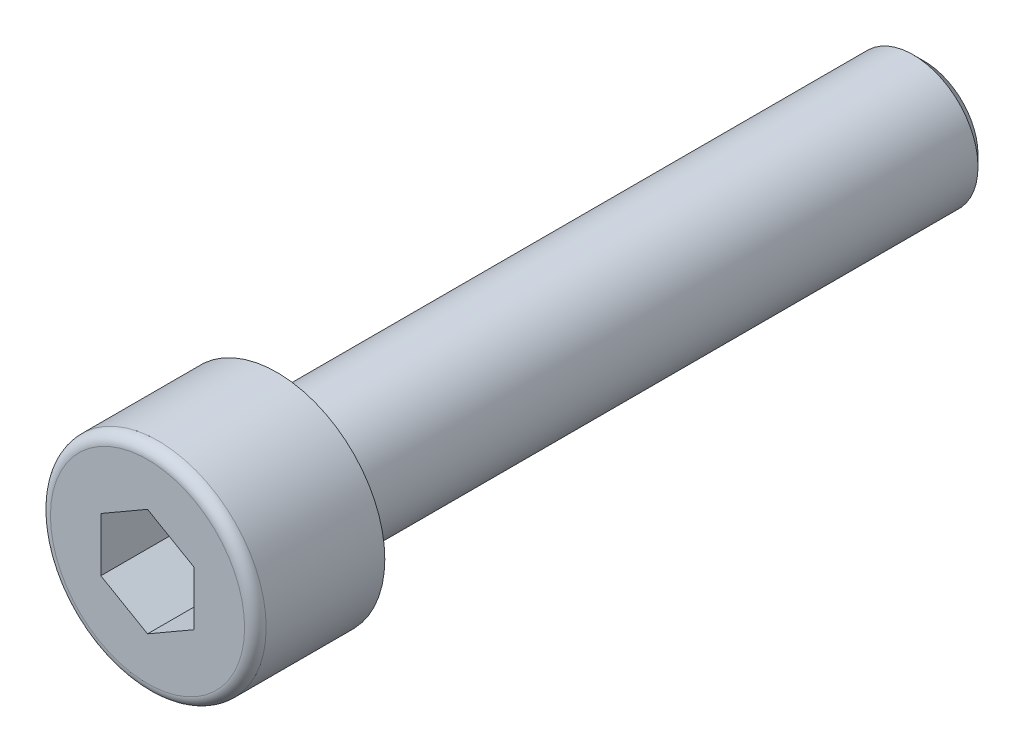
ISO-10303-21;
HEADER;
FILE_DESCRIPTION(('STEP AP214'),'2;1');
FILE_NAME('part.step','',(''),(''),'','','');
FILE_SCHEMA(('AUTOMOTIVE_DESIGN { 1 0 10303 214 1 1 1 1 }'));
ENDSEC;
DATA;
#1=APPLICATION_CONTEXT('core data for automotive mechanical design processes');
#2=APPLICATION_PROTOCOL_DEFINITION('international standard','automotive_design',2000,#1);
#3=PRODUCT_CONTEXT('',#1,'mechanical');
#4=PRODUCT('Part','Part','',(#3));
#5=PRODUCT_RELATED_PRODUCT_CATEGORY('part','',(#4));
#6=PRODUCT_DEFINITION_FORMATION('','',#4);
#7=PRODUCT_DEFINITION_CONTEXT('part definition',#1,'design');
#8=PRODUCT_DEFINITION('design','',#6,#7);
#9=PRODUCT_DEFINITION_SHAPE('','',#8);
#10=(LENGTH_UNIT() NAMED_UNIT(*) SI_UNIT(.MILLI.,.METRE.));
#11=(NAMED_UNIT(*) PLANE_ANGLE_UNIT() SI_UNIT($,.RADIAN.));
#12=(NAMED_UNIT(*) SI_UNIT($,.STERADIAN.) SOLID_ANGLE_UNIT());
#13=UNCERTAINTY_MEASURE_WITH_UNIT(LENGTH_MEASURE(1.E-05),#10,'distance_accuracy_value','');
#14=(GEOMETRIC_REPRESENTATION_CONTEXT(3) GLOBAL_UNCERTAINTY_ASSIGNED_CONTEXT((#13)) GLOBAL_UNIT_ASSIGNED_CONTEXT((#10,
#11,#12)) REPRESENTATION_CONTEXT('',''));
#15=CARTESIAN_POINT('',(0.,0.,0.));
#16=DIRECTION('',(0.,0.,1.));
#17=DIRECTION('',(1.,0.,0.));
#18=AXIS2_PLACEMENT_3D('',#15,#16,#17);
#19=CARTESIAN_POINT('',(0.,0.,30.));
#20=DIRECTION('',(0.,0.,-1.));
#21=DIRECTION('',(-1.,0.,0.));
#22=AXIS2_PLACEMENT_3D('',#19,#20,#21);
#23=CYLINDRICAL_SURFACE('',#22,3.);
#24=CARTESIAN_POINT('',(0.,0.,0.500000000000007));
#25=DIRECTION('',(0.,0.,1.));
#26=DIRECTION('',(1.,0.,0.));
#27=AXIS2_PLACEMENT_3D('',#24,#25,#26);
#28=CIRCLE('',#27,3.);
#29=CARTESIAN_POINT('',(3.,0.,0.500000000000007));
#30=VERTEX_POINT('',#29);
#31=EDGE_CURVE('E41',#30,#30,#28,.T.);
#32=ORIENTED_EDGE('',*,*,#31,.T.);
#33=EDGE_LOOP('',(#32));
#34=FACE_BOUND('',#33,.T.);
#35=CARTESIAN_POINT('',(0.,0.,30.));
#36=DIRECTION('',(0.,0.,1.));
#37=DIRECTION('',(1.,0.,0.));
#38=AXIS2_PLACEMENT_3D('',#35,#36,#37);
#39=CIRCLE('',#38,3.);
#40=CARTESIAN_POINT('',(3.,0.,30.));
#41=VERTEX_POINT('',#40);
#42=EDGE_CURVE('E144',#41,#41,#39,.T.);
#43=ORIENTED_EDGE('',*,*,#42,.F.);
#44=EDGE_LOOP('',(#43));
#45=FACE_BOUND('',#44,.T.);
#46=ADVANCED_FACE('F34',(#34,#45),#23,.T.);
#47=CARTESIAN_POINT('',(0.,0.,0.));
#48=DIRECTION('',(0.,0.,1.));
#49=DIRECTION('',(1.,0.,0.));
#50=AXIS2_PLACEMENT_3D('',#47,#48,#49);
#51=PLANE('',#50);
#52=CARTESIAN_POINT('',(0.,0.,0.));
#53=DIRECTION('',(0.,0.,1.));
#54=DIRECTION('',(1.,0.,0.));
#55=AXIS2_PLACEMENT_3D('',#52,#53,#54);
#56=CIRCLE('',#55,2.5);
#57=CARTESIAN_POINT('',(2.5,0.,0.));
#58=VERTEX_POINT('',#57);
#59=EDGE_CURVE('E11',#58,#58,#56,.F.);
#60=ORIENTED_EDGE('',*,*,#59,.T.);
#61=EDGE_LOOP('',(#60));
#62=FACE_BOUND('',#61,.T.);
#63=ADVANCED_FACE('F170',(#62),#51,.F.);
#64=CARTESIAN_POINT('',(0.,0.,30.));
#65=DIRECTION('',(0.,0.,1.));
#66=DIRECTION('',(1.,0.,0.));
#67=AXIS2_PLACEMENT_3D('',#64,#65,#66);
#68=PLANE('',#67);
#69=CARTESIAN_POINT('',(0.,0.,30.));
#70=DIRECTION('',(0.,0.,1.));
#71=DIRECTION('',(1.,0.,0.));
#72=AXIS2_PLACEMENT_3D('',#69,#70,#71);
#73=CIRCLE('',#72,5.);
#74=CARTESIAN_POINT('',(5.,0.,30.));
#75=VERTEX_POINT('',#74);
#76=EDGE_CURVE('E135',#75,#75,#73,.T.);
#77=ORIENTED_EDGE('',*,*,#76,.F.);
#78=EDGE_LOOP('',(#77));
#79=FACE_BOUND('',#78,.T.);
#80=ORIENTED_EDGE('',*,*,#42,.T.);
#81=EDGE_LOOP('',(#80));
#82=FACE_BOUND('',#81,.T.);
#83=ADVANCED_FACE('F174',(#79,#82),#68,.F.);
#84=CARTESIAN_POINT('',(0.,0.,36.));
#85=DIRECTION('',(0.,0.,-1.));
#86=DIRECTION('',(-1.,0.,0.));
#87=AXIS2_PLACEMENT_3D('',#84,#85,#86);
#88=CYLINDRICAL_SURFACE('',#87,5.);
#89=CARTESIAN_POINT('',(0.,0.,35.5));
#90=DIRECTION('',(0.,0.,1.));
#91=DIRECTION('',(1.,0.,0.));
#92=AXIS2_PLACEMENT_3D('',#89,#90,#91);
#93=CIRCLE('',#92,5.);
#94=CARTESIAN_POINT('',(5.,0.,35.5));
#95=VERTEX_POINT('',#94);
#96=EDGE_CURVE('E150',#95,#95,#93,.F.);
#97=ORIENTED_EDGE('',*,*,#96,.T.);
#98=EDGE_LOOP('',(#97));
#99=FACE_BOUND('',#98,.T.);
#100=ORIENTED_EDGE('',*,*,#76,.T.);
#101=EDGE_LOOP('',(#100));
#102=FACE_BOUND('',#101,.T.);
#103=ADVANCED_FACE('F179',(#99,#102),#88,.T.);
#104=CARTESIAN_POINT('',(0.,0.,36.));
#105=DIRECTION('',(0.,0.,1.));
#106=DIRECTION('',(1.,0.,0.));
#107=AXIS2_PLACEMENT_3D('',#104,#105,#106);
#108=PLANE('',#107);
#109=CARTESIAN_POINT('',(0.,0.,36.));
#110=DIRECTION('',(0.,0.,1.));
#111=DIRECTION('',(1.,0.,0.));
#112=AXIS2_PLACEMENT_3D('',#109,#110,#111);
#113=CIRCLE('',#112,4.5);
#114=CARTESIAN_POINT('',(4.5,0.,36.));
#115=VERTEX_POINT('',#114);
#116=EDGE_CURVE('E147',#115,#115,#113,.T.);
#117=ORIENTED_EDGE('',*,*,#116,.T.);
#118=EDGE_LOOP('',(#117));
#119=FACE_BOUND('',#118,.T.);
#120=DIRECTION('',(-0.866025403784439,0.5,0.));
#121=VECTOR('',#120,1.);
#122=CARTESIAN_POINT('',(2.1650635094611,1.25,36.));
#123=LINE('',#122,#121);
#124=CARTESIAN_POINT('',(2.1650635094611,1.25,36.));
#125=VERTEX_POINT('',#124);
#126=CARTESIAN_POINT('',(0.,2.5,36.));
#127=VERTEX_POINT('',#126);
#128=EDGE_CURVE('E48',#125,#127,#123,.T.);
#129=ORIENTED_EDGE('',*,*,#128,.F.);
#130=DIRECTION('',(0.,1.,0.));
#131=VECTOR('',#130,1.);
#132=CARTESIAN_POINT('',(2.1650635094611,-1.25,36.));
#133=LINE('',#132,#131);
#134=CARTESIAN_POINT('',(2.1650635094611,-1.25,36.));
#135=VERTEX_POINT('',#134);
#136=EDGE_CURVE('E117',#135,#125,#133,.T.);
#137=ORIENTED_EDGE('',*,*,#136,.F.);
#138=DIRECTION('',(0.866025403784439,0.5,0.));
#139=VECTOR('',#138,1.);
#140=CARTESIAN_POINT('',(0.,-2.5,36.));
#141=LINE('',#140,#139);
#142=CARTESIAN_POINT('',(0.,-2.5,36.));
#143=VERTEX_POINT('',#142);
#144=EDGE_CURVE('E111',#143,#135,#141,.T.);
#145=ORIENTED_EDGE('',*,*,#144,.F.);
#146=DIRECTION('',(0.866025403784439,-0.5,0.));
#147=VECTOR('',#146,1.);
#148=CARTESIAN_POINT('',(-2.1650635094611,-1.25,36.));
#149=LINE('',#148,#147);
#150=CARTESIAN_POINT('',(-2.1650635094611,-1.25,36.));
#151=VERTEX_POINT('',#150);
#152=EDGE_CURVE('E109',#151,#143,#149,.T.);
#153=ORIENTED_EDGE('',*,*,#152,.F.);
#154=DIRECTION('',(0.,-1.,0.));
#155=VECTOR('',#154,1.);
#156=CARTESIAN_POINT('',(-2.1650635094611,1.25,36.));
#157=LINE('',#156,#155);
#158=CARTESIAN_POINT('',(-2.1650635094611,1.25,36.));
#159=VERTEX_POINT('',#158);
#160=EDGE_CURVE('E91',#159,#151,#157,.T.);
#161=ORIENTED_EDGE('',*,*,#160,.F.);
#162=DIRECTION('',(-0.866025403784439,-0.5,0.));
#163=VECTOR('',#162,1.);
#164=CARTESIAN_POINT('',(0.,2.5,36.));
#165=LINE('',#164,#163);
#166=EDGE_CURVE('E102',#127,#159,#165,.T.);
#167=ORIENTED_EDGE('',*,*,#166,.F.);
#168=EDGE_LOOP('',(#129,#137,#145,#153,#161,#167));
#169=FACE_BOUND('',#168,.T.);
#170=ADVANCED_FACE('F106',(#119,#169),#108,.T.);
#171=CARTESIAN_POINT('',(2.1650635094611,1.25,32.5));
#172=DIRECTION('',(0.5,0.866025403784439,0.));
#173=DIRECTION('',(-0.866025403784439,0.5,0.));
#174=AXIS2_PLACEMENT_3D('',#171,#172,#173);
#175=PLANE('',#174);
#176=ORIENTED_EDGE('',*,*,#128,.T.);
#177=DIRECTION('',(0.,0.,1.));
#178=VECTOR('',#177,1.);
#179=CARTESIAN_POINT('',(0.,2.5,32.5));
#180=LINE('',#179,#178);
#181=CARTESIAN_POINT('',(0.,2.5,32.5));
#182=VERTEX_POINT('',#181);
#183=EDGE_CURVE('E99',#182,#127,#180,.T.);
#184=ORIENTED_EDGE('',*,*,#183,.F.);
#185=DIRECTION('',(-0.866025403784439,0.5,0.));
#186=VECTOR('',#185,1.);
#187=CARTESIAN_POINT('',(2.1650635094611,1.25,32.5));
#188=LINE('',#187,#186);
#189=CARTESIAN_POINT('',(2.1650635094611,1.25,32.5));
#190=VERTEX_POINT('',#189);
#191=EDGE_CURVE('E119',#190,#182,#188,.T.);
#192=ORIENTED_EDGE('',*,*,#191,.F.);
#193=DIRECTION('',(0.,0.,1.));
#194=VECTOR('',#193,1.);
#195=CARTESIAN_POINT('',(2.1650635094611,1.25,32.5));
#196=LINE('',#195,#194);
#197=EDGE_CURVE('E55',#190,#125,#196,.T.);
#198=ORIENTED_EDGE('',*,*,#197,.T.);
#199=EDGE_LOOP('',(#176,#184,#192,#198));
#200=FACE_BOUND('',#199,.T.);
#201=ADVANCED_FACE('F187',(#200),#175,.F.);
#202=CARTESIAN_POINT('',(2.1650635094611,-1.25,32.5));
#203=DIRECTION('',(1.,0.,0.));
#204=DIRECTION('',(0.,1.,0.));
#205=AXIS2_PLACEMENT_3D('',#202,#203,#204);
#206=PLANE('',#205);
#207=ORIENTED_EDGE('',*,*,#136,.T.);
#208=ORIENTED_EDGE('',*,*,#197,.F.);
#209=DIRECTION('',(0.,1.,0.));
#210=VECTOR('',#209,1.);
#211=CARTESIAN_POINT('',(2.1650635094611,-1.25,32.5));
#212=LINE('',#211,#210);
#213=CARTESIAN_POINT('',(2.1650635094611,-1.25,32.5));
#214=VERTEX_POINT('',#213);
#215=EDGE_CURVE('E131',#214,#190,#212,.T.);
#216=ORIENTED_EDGE('',*,*,#215,.F.);
#217=DIRECTION('',(0.,0.,1.));
#218=VECTOR('',#217,1.);
#219=CARTESIAN_POINT('',(2.1650635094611,-1.25,32.5));
#220=LINE('',#219,#218);
#221=EDGE_CURVE('E136',#214,#135,#220,.T.);
#222=ORIENTED_EDGE('',*,*,#221,.T.);
#223=EDGE_LOOP('',(#207,#208,#216,#222));
#224=FACE_BOUND('',#223,.T.);
#225=ADVANCED_FACE('F192',(#224),#206,.F.);
#226=CARTESIAN_POINT('',(0.,-2.5,32.5));
#227=DIRECTION('',(0.5,-0.866025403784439,0.));
#228=DIRECTION('',(0.866025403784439,0.5,0.));
#229=AXIS2_PLACEMENT_3D('',#226,#227,#228);
#230=PLANE('',#229);
#231=ORIENTED_EDGE('',*,*,#144,.T.);
#232=ORIENTED_EDGE('',*,*,#221,.F.);
#233=DIRECTION('',(0.866025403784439,0.5,0.));
#234=VECTOR('',#233,1.);
#235=CARTESIAN_POINT('',(0.,-2.5,32.5));
#236=LINE('',#235,#234);
#237=CARTESIAN_POINT('',(0.,-2.5,32.5));
#238=VERTEX_POINT('',#237);
#239=EDGE_CURVE('E128',#238,#214,#236,.T.);
#240=ORIENTED_EDGE('',*,*,#239,.F.);
#241=DIRECTION('',(0.,0.,1.));
#242=VECTOR('',#241,1.);
#243=CARTESIAN_POINT('',(0.,-2.5,32.5));
#244=LINE('',#243,#242);
#245=EDGE_CURVE('E138',#238,#143,#244,.T.);
#246=ORIENTED_EDGE('',*,*,#245,.T.);
#247=EDGE_LOOP('',(#231,#232,#240,#246));
#248=FACE_BOUND('',#247,.T.);
#249=ADVANCED_FACE('F200',(#248),#230,.F.);
#250=CARTESIAN_POINT('',(-2.1650635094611,-1.25,32.5));
#251=DIRECTION('',(-0.5,-0.866025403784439,0.));
#252=DIRECTION('',(0.866025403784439,-0.5,0.));
#253=AXIS2_PLACEMENT_3D('',#250,#251,#252);
#254=PLANE('',#253);
#255=ORIENTED_EDGE('',*,*,#152,.T.);
#256=ORIENTED_EDGE('',*,*,#245,.F.);
#257=DIRECTION('',(0.866025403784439,-0.5,0.));
#258=VECTOR('',#257,1.);
#259=CARTESIAN_POINT('',(-2.1650635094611,-1.25,32.5));
#260=LINE('',#259,#258);
#261=CARTESIAN_POINT('',(-2.1650635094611,-1.25,32.5));
#262=VERTEX_POINT('',#261);
#263=EDGE_CURVE('E125',#262,#238,#260,.T.);
#264=ORIENTED_EDGE('',*,*,#263,.F.);
#265=DIRECTION('',(0.,0.,1.));
#266=VECTOR('',#265,1.);
#267=CARTESIAN_POINT('',(-2.1650635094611,-1.25,32.5));
#268=LINE('',#267,#266);
#269=EDGE_CURVE('E98',#262,#151,#268,.T.);
#270=ORIENTED_EDGE('',*,*,#269,.T.);
#271=EDGE_LOOP('',(#255,#256,#264,#270));
#272=FACE_BOUND('',#271,.T.);
#273=ADVANCED_FACE('F197',(#272),#254,.F.);
#274=CARTESIAN_POINT('',(-2.1650635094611,1.25,32.5));
#275=DIRECTION('',(-1.,0.,0.));
#276=DIRECTION('',(0.,-1.,0.));
#277=AXIS2_PLACEMENT_3D('',#274,#275,#276);
#278=PLANE('',#277);
#279=ORIENTED_EDGE('',*,*,#160,.T.);
#280=ORIENTED_EDGE('',*,*,#269,.F.);
#281=DIRECTION('',(0.,-1.,0.));
#282=VECTOR('',#281,1.);
#283=CARTESIAN_POINT('',(-2.1650635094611,1.25,32.5));
#284=LINE('',#283,#282);
#285=CARTESIAN_POINT('',(-2.1650635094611,1.25,32.5));
#286=VERTEX_POINT('',#285);
#287=EDGE_CURVE('E94',#286,#262,#284,.T.);
#288=ORIENTED_EDGE('',*,*,#287,.F.);
#289=DIRECTION('',(0.,0.,1.));
#290=VECTOR('',#289,1.);
#291=CARTESIAN_POINT('',(-2.1650635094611,1.25,32.5));
#292=LINE('',#291,#290);
#293=EDGE_CURVE('E87',#286,#159,#292,.T.);
#294=ORIENTED_EDGE('',*,*,#293,.T.);
#295=EDGE_LOOP('',(#279,#280,#288,#294));
#296=FACE_BOUND('',#295,.T.);
#297=ADVANCED_FACE('F89',(#296),#278,.F.);
#298=CARTESIAN_POINT('',(0.,2.5,32.5));
#299=DIRECTION('',(-0.5,0.866025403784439,0.));
#300=DIRECTION('',(-0.866025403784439,-0.5,0.));
#301=AXIS2_PLACEMENT_3D('',#298,#299,#300);
#302=PLANE('',#301);
#303=ORIENTED_EDGE('',*,*,#166,.T.);
#304=ORIENTED_EDGE('',*,*,#293,.F.);
#305=DIRECTION('',(-0.866025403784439,-0.5,0.));
#306=VECTOR('',#305,1.);
#307=CARTESIAN_POINT('',(0.,2.5,32.5));
#308=LINE('',#307,#306);
#309=EDGE_CURVE('E122',#182,#286,#308,.T.);
#310=ORIENTED_EDGE('',*,*,#309,.F.);
#311=ORIENTED_EDGE('',*,*,#183,.T.);
#312=EDGE_LOOP('',(#303,#304,#310,#311));
#313=FACE_BOUND('',#312,.T.);
#314=ADVANCED_FACE('F103',(#313),#302,.F.);
#315=CARTESIAN_POINT('',(2.1650635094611,1.25,32.5));
#316=DIRECTION('',(0.,0.,-1.));
#317=DIRECTION('',(-1.,0.,0.));
#318=AXIS2_PLACEMENT_3D('',#315,#316,#317);
#319=PLANE('',#318);
#320=ORIENTED_EDGE('',*,*,#191,.T.);
#321=ORIENTED_EDGE('',*,*,#309,.T.);
#322=ORIENTED_EDGE('',*,*,#287,.T.);
#323=ORIENTED_EDGE('',*,*,#263,.T.);
#324=ORIENTED_EDGE('',*,*,#239,.T.);
#325=ORIENTED_EDGE('',*,*,#215,.T.);
#326=EDGE_LOOP('',(#320,#321,#322,#323,#324,#325));
#327=FACE_BOUND('',#326,.T.);
#328=ADVANCED_FACE('F165',(#327),#319,.F.);
#329=CARTESIAN_POINT('',(0.,0.,35.5));
#330=DIRECTION('',(0.,0.,1.));
#331=DIRECTION('',(1.,0.,0.));
#332=AXIS2_PLACEMENT_3D('',#329,#330,#331);
#333=TOROIDAL_SURFACE('',#332,4.5,0.5);
#334=ORIENTED_EDGE('',*,*,#96,.F.);
#335=EDGE_LOOP('',(#334));
#336=FACE_BOUND('',#335,.T.);
#337=ORIENTED_EDGE('',*,*,#116,.F.);
#338=EDGE_LOOP('',(#337));
#339=FACE_BOUND('',#338,.T.);
#340=ADVANCED_FACE('F159',(#336,#339),#333,.T.);
#341=CARTESIAN_POINT('',(0.,0.,0.500000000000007));
#342=DIRECTION('',(0.,0.,1.));
#343=DIRECTION('',(1.,0.,0.));
#344=AXIS2_PLACEMENT_3D('',#341,#342,#343);
#345=CONICAL_SURFACE('',#344,3.,0.785398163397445);
#346=ORIENTED_EDGE('',*,*,#59,.F.);
#347=EDGE_LOOP('',(#346));
#348=FACE_BOUND('',#347,.T.);
#349=ORIENTED_EDGE('',*,*,#31,.F.);
#350=EDGE_LOOP('',(#349));
#351=FACE_BOUND('',#350,.T.);
#352=ADVANCED_FACE('F157',(#348,#351),#345,.T.);
#353=CLOSED_SHELL('',(#46,#63,#83,#103,#170,#201,#225,#249,#273,#297,#314,#328,#340,#352));
#354=MANIFOLD_SOLID_BREP('B2',#353);
#355=ADVANCED_BREP_SHAPE_REPRESENTATION('',(#18,#354),#14);
#356=SHAPE_DEFINITION_REPRESENTATION(#9,#355);
ENDSEC;
END-ISO-10303-21;
